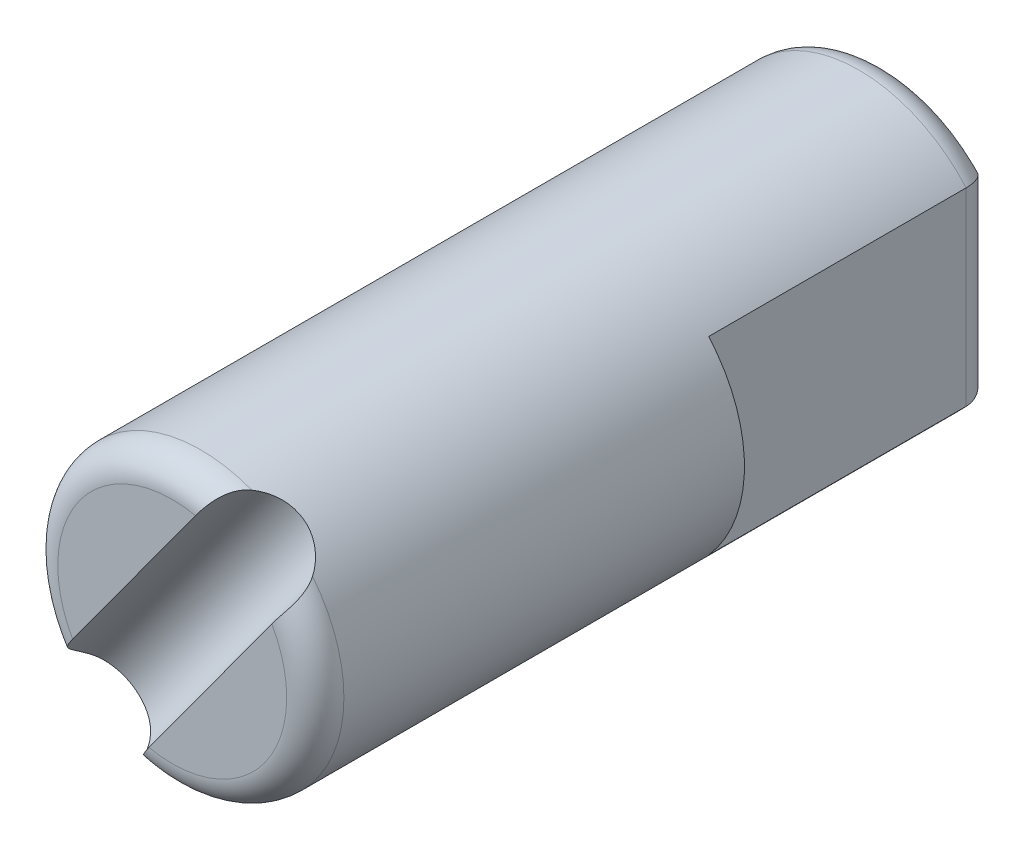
ISO-10303-21;
HEADER;
FILE_DESCRIPTION(('STEP AP214'),'2;1');
FILE_NAME('part.step','',(''),(''),'','','');
FILE_SCHEMA(('AUTOMOTIVE_DESIGN { 1 0 10303 214 1 1 1 1 }'));
ENDSEC;
DATA;
#1=APPLICATION_CONTEXT('core data for automotive mechanical design processes');
#2=APPLICATION_PROTOCOL_DEFINITION('international standard','automotive_design',2000,#1);
#3=PRODUCT_CONTEXT('',#1,'mechanical');
#4=PRODUCT('Part','Part','',(#3));
#5=PRODUCT_RELATED_PRODUCT_CATEGORY('part','',(#4));
#6=PRODUCT_DEFINITION_FORMATION('','',#4);
#7=PRODUCT_DEFINITION_CONTEXT('part definition',#1,'design');
#8=PRODUCT_DEFINITION('design','',#6,#7);
#9=PRODUCT_DEFINITION_SHAPE('','',#8);
#10=(LENGTH_UNIT() NAMED_UNIT(*) SI_UNIT(.MILLI.,.METRE.));
#11=(NAMED_UNIT(*) PLANE_ANGLE_UNIT() SI_UNIT($,.RADIAN.));
#12=(NAMED_UNIT(*) SI_UNIT($,.STERADIAN.) SOLID_ANGLE_UNIT());
#13=UNCERTAINTY_MEASURE_WITH_UNIT(LENGTH_MEASURE(1.E-05),#10,'distance_accuracy_value','');
#14=(GEOMETRIC_REPRESENTATION_CONTEXT(3) GLOBAL_UNCERTAINTY_ASSIGNED_CONTEXT((#13)) GLOBAL_UNIT_ASSIGNED_CONTEXT((#10,
#11,#12)) REPRESENTATION_CONTEXT('',''));
#15=CARTESIAN_POINT('',(0.,0.,0.));
#16=DIRECTION('',(0.,0.,1.));
#17=DIRECTION('',(1.,0.,0.));
#18=AXIS2_PLACEMENT_3D('',#15,#16,#17);
#19=CARTESIAN_POINT('',(0.,0.,50.));
#20=DIRECTION('',(0.,0.,1.));
#21=DIRECTION('',(1.,0.,0.));
#22=AXIS2_PLACEMENT_3D('',#19,#20,#21);
#23=PLANE('',#22);
#24=DIRECTION('',(0.589196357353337,0.807989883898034,0.));
#25=VECTOR('',#24,1.);
#26=CARTESIAN_POINT('',(8.90000447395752,6.60410325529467,50.));
#27=LINE('',#26,#25);
#28=CARTESIAN_POINT('',(-1.62749658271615,-7.83270418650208,50.));
#29=VERTEX_POINT('',#28);
#30=CARTESIAN_POINT('',(6.96022981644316,3.94400822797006,50.));
#31=VERTEX_POINT('',#30);
#32=EDGE_CURVE('E114',#29,#31,#27,.T.);
#33=ORIENTED_EDGE('',*,*,#32,.F.);
#34=CARTESIAN_POINT('',(0.,0.,50.));
#35=DIRECTION('',(0.,0.,1.));
#36=DIRECTION('',(1.,0.,0.));
#37=AXIS2_PLACEMENT_3D('',#34,#35,#36);
#38=CIRCLE('',#37,7.99999999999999);
#39=EDGE_CURVE('E125',#29,#31,#38,.T.);
#40=ORIENTED_EDGE('',*,*,#39,.T.);
#41=EDGE_LOOP('',(#33,#40));
#42=FACE_BOUND('',#41,.T.);
#43=ADVANCED_FACE('F32',(#42),#23,.T.);
#44=CARTESIAN_POINT('',(0.,0.,48.));
#45=DIRECTION('',(0.,0.,1.));
#46=DIRECTION('',(1.,0.,0.));
#47=AXIS2_PLACEMENT_3D('',#44,#45,#46);
#48=TOROIDAL_SURFACE('',#47,7.99999999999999,2.);
#49=CARTESIAN_POINT('',(3.56463353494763,9.34309304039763,47.9998));
#50=CARTESIAN_POINT('',(3.52757732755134,9.35724684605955,48.0500111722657));
#51=CARTESIAN_POINT('',(3.49079239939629,9.36899937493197,48.1011105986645));
#52=CARTESIAN_POINT('',(3.41774052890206,9.3874484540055,48.2045984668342));
#53=CARTESIAN_POINT('',(3.38147374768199,9.39414346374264,48.2569872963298));
#54=CARTESIAN_POINT('',(3.30947471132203,9.40221306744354,48.3625080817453));
#55=CARTESIAN_POINT('',(3.27374219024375,9.40359040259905,48.4156396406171));
#56=CARTESIAN_POINT('',(3.20277851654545,9.40089063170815,48.5220676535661));
#57=CARTESIAN_POINT('',(3.16754729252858,9.39681431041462,48.5753640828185));
#58=CARTESIAN_POINT('',(3.06232871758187,9.37622633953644,48.7349036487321));
#59=CARTESIAN_POINT('',(2.99294805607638,9.35134001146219,48.8405993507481));
#60=CARTESIAN_POINT('',(2.85535411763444,9.28000669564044,49.0450242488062));
#61=CARTESIAN_POINT('',(2.7871398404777,9.23357925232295,49.1437596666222));
#62=CARTESIAN_POINT('',(2.65301511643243,9.12338388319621,49.3264695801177));
#63=CARTESIAN_POINT('',(2.58710472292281,9.06025503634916,49.4108301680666));
#64=CARTESIAN_POINT('',(2.45420304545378,8.91913828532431,49.5650988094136));
#65=CARTESIAN_POINT('',(2.38721127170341,8.8411434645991,49.6350001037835));
#66=CARTESIAN_POINT('',(2.25048564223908,8.67300977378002,49.758379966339));
#67=CARTESIAN_POINT('',(2.18072777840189,8.58272936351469,49.8116388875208));
#68=CARTESIAN_POINT('',(2.03902033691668,8.39490313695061,49.898809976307));
#69=CARTESIAN_POINT('',(1.96707112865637,8.29735854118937,49.9327253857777));
#70=CARTESIAN_POINT('',(1.81976564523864,8.09643629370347,49.9811725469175));
#71=CARTESIAN_POINT('',(1.7443690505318,7.99297578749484,49.9952358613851));
#72=CARTESIAN_POINT('',(1.59311787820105,7.78555923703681,50.0027269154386));
#73=CARTESIAN_POINT('',(1.51726297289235,7.68160285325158,49.9961375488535));
#74=CARTESIAN_POINT('',(1.36373413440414,7.47070521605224,49.9621433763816));
#75=CARTESIAN_POINT('',(1.28614696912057,7.36385932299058,49.9337571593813));
#76=CARTESIAN_POINT('',(1.13638198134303,7.15424471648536,49.85551803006));
#77=CARTESIAN_POINT('',(1.06420166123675,7.0514741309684,49.8056751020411));
#78=CARTESIAN_POINT('',(0.947779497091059,6.87794084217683,49.7002384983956));
#79=CARTESIAN_POINT('',(0.901155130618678,6.80580805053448,49.6495162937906));
#80=CARTESIAN_POINT('',(0.816661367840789,6.66599274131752,49.536054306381));
#81=CARTESIAN_POINT('',(0.778775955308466,6.59830224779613,49.4733368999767));
#82=CARTESIAN_POINT('',(0.723244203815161,6.48447139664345,49.3523198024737));
#83=CARTESIAN_POINT('',(0.702929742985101,6.43702322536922,49.296489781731));
#84=CARTESIAN_POINT('',(0.671917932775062,6.34696648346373,49.1785834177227));
#85=CARTESIAN_POINT('',(0.661209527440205,6.30435239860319,49.1165143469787));
#86=CARTESIAN_POINT('',(0.651322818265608,6.22494593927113,48.9871582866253));
#87=CARTESIAN_POINT('',(0.65223321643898,6.18820052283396,48.9198350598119));
#88=CARTESIAN_POINT('',(0.666755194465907,6.1219340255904,48.783077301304));
#89=CARTESIAN_POINT('',(0.680360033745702,6.09240912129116,48.7136439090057));
#90=CARTESIAN_POINT('',(0.717415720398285,6.04333864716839,48.5829829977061));
#91=CARTESIAN_POINT('',(0.739655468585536,6.02306279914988,48.5216733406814));
#92=CARTESIAN_POINT('',(0.792385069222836,5.98750909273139,48.4010806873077));
#93=CARTESIAN_POINT('',(0.822892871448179,5.97224227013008,48.3418024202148));
#94=CARTESIAN_POINT('',(0.886018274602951,5.94755003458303,48.234112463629));
#95=CARTESIAN_POINT('',(0.917797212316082,5.93761462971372,48.1853130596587));
#96=CARTESIAN_POINT('',(0.985269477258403,5.92016508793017,48.0905135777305));
#97=CARTESIAN_POINT('',(1.02093609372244,5.91263567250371,48.0444974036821));
#98=CARTESIAN_POINT('',(1.05822097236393,5.90594348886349,47.9998));
#99=B_SPLINE_CURVE_WITH_KNOTS('',3,(#49,#50,#51,#52,#53,#54,#55,#56,#57,#58,#59,#60,#61,#62,#63,
#64,#65,#66,#67,#68,#69,#70,#71,#72,#73,#74,#75,#76,#77,#78,#79,#80,#81,#82,#83,#84,#85,#86,#87,
#88,#89,#90,#91,#92,#93,#94,#95,#96,#97,#98),.UNSPECIFIED.,.F.,.F.,(4,2,2,2,2,2,2,2,2,2,2,2,2,2,
2,2,2,2,2,2,2,2,2,2,4),(0.,0.19192973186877,0.383917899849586,0.575807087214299,
0.76766866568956,1.15209635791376,1.53617593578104,1.90727493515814,2.27854701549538,
2.65453025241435,3.03045045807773,3.41510065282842,3.80006952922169,4.20346831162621,
4.60667958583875,4.90496817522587,5.20270565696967,5.42995121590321,5.65693489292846,
5.8856524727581,6.11424867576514,6.31835257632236,6.52290318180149,6.69988226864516,
6.87571407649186),.UNSPECIFIED.);
#100=CARTESIAN_POINT('',(3.56448597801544,9.34314934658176,48.));
#101=VERTEX_POINT('',#100);
#102=CARTESIAN_POINT('',(1.62749658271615,7.83270418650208,50.));
#103=VERTEX_POINT('',#102);
#104=EDGE_CURVE('E12',#101,#103,#99,.T.);
#105=ORIENTED_EDGE('',*,*,#104,.F.);
#106=CARTESIAN_POINT('',(0.,0.,48.));
#107=DIRECTION('',(0.,0.,1.));
#108=DIRECTION('',(1.,0.,0.));
#109=AXIS2_PLACEMENT_3D('',#106,#107,#108);
#110=CIRCLE('',#109,9.99999999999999);
#111=CARTESIAN_POINT('',(-7.80624048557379,-6.25000875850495,48.));
#112=VERTEX_POINT('',#111);
#113=EDGE_CURVE('E246',#112,#101,#110,.F.);
#114=ORIENTED_EDGE('',*,*,#113,.F.);
#115=CARTESIAN_POINT('',(-5.2997292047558,-2.81298248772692,47.9998));
#116=CARTESIAN_POINT('',(-5.32494747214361,-2.76554222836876,48.0631389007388));
#117=CARTESIAN_POINT('',(-5.35080144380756,-2.72162487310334,48.129345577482));
#118=CARTESIAN_POINT('',(-5.40513800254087,-2.64341208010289,48.267434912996));
#119=CARTESIAN_POINT('',(-5.43365062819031,-2.60925044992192,48.3393806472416));
#120=CARTESIAN_POINT('',(-5.49434556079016,-2.55427085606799,48.4878910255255));
#121=CARTESIAN_POINT('',(-5.52656068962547,-2.53358513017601,48.5644936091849));
#122=CARTESIAN_POINT('',(-5.59477755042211,-2.50928679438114,48.7182392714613));
#123=CARTESIAN_POINT('',(-5.63075269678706,-2.5055616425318,48.7953753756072));
#124=CARTESIAN_POINT('',(-5.70076219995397,-2.51492526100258,48.9355540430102));
#125=CARTESIAN_POINT('',(-5.73431157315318,-2.52563586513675,48.9990085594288));
#126=CARTESIAN_POINT('',(-5.80355275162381,-2.55872756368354,49.1216995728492));
#127=CARTESIAN_POINT('',(-5.83924958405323,-2.58113706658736,49.1809254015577));
#128=CARTESIAN_POINT('',(-5.92033409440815,-2.64177635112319,49.3062940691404));
#129=CARTESIAN_POINT('',(-5.96609959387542,-2.68242710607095,49.3710089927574));
#130=CARTESIAN_POINT('',(-6.05919009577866,-2.77444874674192,49.4909377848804));
#131=CARTESIAN_POINT('',(-6.10651733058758,-2.82583559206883,49.5461372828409));
#132=CARTESIAN_POINT('',(-6.21971119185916,-2.95616550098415,49.6651760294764));
#133=CARTESIAN_POINT('',(-6.2861038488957,-3.03836021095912,49.7249426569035));
#134=CARTESIAN_POINT('',(-6.42087064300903,-3.21138198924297,49.827114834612));
#135=CARTESIAN_POINT('',(-6.48924684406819,-3.30221829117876,49.8695015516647));
#136=CARTESIAN_POINT('',(-6.6292459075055,-3.49081018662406,49.9376438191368));
#137=CARTESIAN_POINT('',(-6.70090687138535,-3.58867167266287,49.9630275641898));
#138=CARTESIAN_POINT('',(-6.84540674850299,-3.78648621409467,49.9952633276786));
#139=CARTESIAN_POINT('',(-6.91824523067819,-3.88643850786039,50.0021219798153));
#140=CARTESIAN_POINT('',(-7.07182059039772,-4.09703142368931,49.996446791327));
#141=CARTESIAN_POINT('',(-7.15254231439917,-4.20763467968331,49.9816900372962));
#142=CARTESIAN_POINT('',(-7.31053585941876,-4.42553916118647,49.9283055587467));
#143=CARTESIAN_POINT('',(-7.38780765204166,-4.53284035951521,49.8896776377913));
#144=CARTESIAN_POINT('',(-7.531254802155,-4.73767343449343,49.7915653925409));
#145=CARTESIAN_POINT('',(-7.59775976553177,-4.83542632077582,49.7330244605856));
#146=CARTESIAN_POINT('',(-7.71880025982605,-5.02498466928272,49.5970045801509));
#147=CARTESIAN_POINT('',(-7.77333828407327,-5.11679136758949,49.5195295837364));
#148=CARTESIAN_POINT('',(-7.86434244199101,-5.29104779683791,49.3520853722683));
#149=CARTESIAN_POINT('',(-7.90137147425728,-5.37371197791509,49.2626448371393));
#150=CARTESIAN_POINT('',(-7.95676390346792,-5.53332686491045,49.0734858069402));
#151=CARTESIAN_POINT('',(-7.97513161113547,-5.61027888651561,48.9737696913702));
#152=CARTESIAN_POINT('',(-7.99096976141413,-5.75729152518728,48.7709470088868));
#153=CARTESIAN_POINT('',(-7.9888581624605,-5.82746057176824,48.6679508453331));
#154=CARTESIAN_POINT('',(-7.96421921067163,-5.96308753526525,48.461330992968));
#155=CARTESIAN_POINT('',(-7.94170233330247,-6.02854785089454,48.3577076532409));
#156=CARTESIAN_POINT('',(-7.89571880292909,-6.1190073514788,48.2123854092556));
#157=CARTESIAN_POINT('',(-7.88014466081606,-6.14575581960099,48.1691316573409));
#158=CARTESIAN_POINT('',(-7.84562975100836,-6.19848367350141,48.0836587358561));
#159=CARTESIAN_POINT('',(-7.82669675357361,-6.22446467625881,48.0414374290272));
#160=CARTESIAN_POINT('',(-7.80614176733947,-6.2501320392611,47.9997999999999));
#161=B_SPLINE_CURVE_WITH_KNOTS('',3,(#115,#116,#117,#118,#119,#120,#121,#122,#123,#124,#125,
#126,#127,#128,#129,#130,#131,#132,#133,#134,#135,#136,#137,#138,#139,#140,#141,#142,#143,#144,
#145,#146,#147,#148,#149,#150,#151,#152,#153,#154,#155,#156,#157,#158,#159,#160),.UNSPECIFIED.,
.F.,.F.,(4,2,2,2,2,2,2,2,2,2,2,2,2,2,2,2,2,2,2,2,2,2,4),(0.,0.249615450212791,0.502506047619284,
0.757842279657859,1.01148173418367,1.22804565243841,1.44513791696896,1.71092088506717,
1.97710179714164,2.33935625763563,2.70200223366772,3.0723397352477,3.44254460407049,
3.85359154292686,4.2646418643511,4.65844028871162,5.0521565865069,5.43217032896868,
5.81209626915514,6.18428495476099,6.55628267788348,6.71574746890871,6.87484805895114),.UNSPECIFIED.);
#162=CARTESIAN_POINT('',(-6.96022981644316,-3.94400822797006,50.));
#163=VERTEX_POINT('',#162);
#164=EDGE_CURVE('E120',#163,#112,#161,.T.);
#165=ORIENTED_EDGE('',*,*,#164,.F.);
#166=EDGE_CURVE('E121',#103,#163,#38,.T.);
#167=ORIENTED_EDGE('',*,*,#166,.F.);
#168=EDGE_LOOP('',(#105,#114,#165,#167));
#169=FACE_BOUND('',#168,.T.);
#170=ADVANCED_FACE('F205',(#169),#48,.T.);
#171=CARTESIAN_POINT('',(0.,0.,50.));
#172=DIRECTION('',(0.,0.,-1.));
#173=DIRECTION('',(-1.,0.,0.));
#174=AXIS2_PLACEMENT_3D('',#171,#172,#173);
#175=CYLINDRICAL_SURFACE('',#174,9.99999999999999);
#176=ORIENTED_EDGE('',*,*,#113,.T.);
#177=CARTESIAN_POINT('',(3.56448597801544,9.34314934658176,48.));
#178=CARTESIAN_POINT('',(3.61917920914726,9.32228215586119,47.9258715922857));
#179=CARTESIAN_POINT('',(3.67653799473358,9.29984980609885,47.8542105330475));
#180=CARTESIAN_POINT('',(3.796067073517,9.25170467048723,47.7161957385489));
#181=CARTESIAN_POINT('',(3.85823751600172,9.22599178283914,47.64984216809));
#182=CARTESIAN_POINT('',(4.05122312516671,9.14369145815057,47.4592672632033));
#183=CARTESIAN_POINT('',(4.18847651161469,9.08195566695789,47.3435801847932));
#184=CARTESIAN_POINT('',(4.47504764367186,8.94422943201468,47.1383659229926));
#185=CARTESIAN_POINT('',(4.6243776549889,8.86822438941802,47.048865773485));
#186=CARTESIAN_POINT('',(4.92963860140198,8.7022273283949,46.8990395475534));
#187=CARTESIAN_POINT('',(5.08556333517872,8.61224824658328,46.8386866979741));
#188=CARTESIAN_POINT('',(5.39420144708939,8.42226250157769,46.7505516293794));
#189=CARTESIAN_POINT('',(5.54688361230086,8.32260409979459,46.7219106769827));
#190=CARTESIAN_POINT('',(5.84829578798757,8.11363289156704,46.695347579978));
#191=CARTESIAN_POINT('',(5.99702580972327,8.00432011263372,46.6974253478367));
#192=CARTESIAN_POINT('',(6.28043854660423,7.78377394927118,46.7315476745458));
#193=CARTESIAN_POINT('',(6.41544015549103,7.67277088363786,46.7624520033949));
#194=CARTESIAN_POINT('',(6.67428795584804,7.44870450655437,46.8514997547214));
#195=CARTESIAN_POINT('',(6.79813262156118,7.33564091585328,46.909646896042));
#196=CARTESIAN_POINT('',(7.03394400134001,7.10990035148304,47.052288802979));
#197=CARTESIAN_POINT('',(7.14571868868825,6.99725129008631,47.13714339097));
#198=CARTESIAN_POINT('',(7.35381419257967,6.778217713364,47.3304921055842));
#199=CARTESIAN_POINT('',(7.45014219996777,6.6718302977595,47.4389751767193));
#200=CARTESIAN_POINT('',(7.58827822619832,6.51335964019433,47.6252464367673));
#201=CARTESIAN_POINT('',(7.63564320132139,6.45769575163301,47.6960085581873));
#202=CARTESIAN_POINT('',(7.72496769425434,6.35056849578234,47.8435743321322));
#203=CARTESIAN_POINT('',(7.76693783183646,6.29909695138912,47.9203656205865));
#204=CARTESIAN_POINT('',(7.80624048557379,6.25000875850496,48.));
#205=B_SPLINE_CURVE_WITH_KNOTS('',3,(#177,#178,#179,#180,#181,#182,#183,#184,#185,#186,#187,
#188,#189,#190,#191,#192,#193,#194,#195,#196,#197,#198,#199,#200,#201,#202,#203,#204),
.UNSPECIFIED.,.F.,.F.,(4,2,2,2,2,2,2,2,2,2,2,2,2,4),(0.,0.283190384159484,0.566389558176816,
1.1329711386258,1.70013557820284,2.26677805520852,2.81766955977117,3.36855949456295,
3.89854319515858,4.42859926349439,4.96612657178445,5.50340291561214,5.80822925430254,
6.11244603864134),.UNSPECIFIED.);
#206=CARTESIAN_POINT('',(7.80624048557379,6.25000875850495,48.));
#207=VERTEX_POINT('',#206);
#208=EDGE_CURVE('E126',#101,#207,#205,.T.);
#209=ORIENTED_EDGE('',*,*,#208,.T.);
#210=CARTESIAN_POINT('',(-3.56448597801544,-9.34314934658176,48.));
#211=VERTEX_POINT('',#210);
#212=EDGE_CURVE('E245',#207,#211,#110,.F.);
#213=ORIENTED_EDGE('',*,*,#212,.T.);
#214=CARTESIAN_POINT('',(-3.56448597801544,-9.34314934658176,48.));
#215=CARTESIAN_POINT('',(-3.61917920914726,-9.32228215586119,47.9258715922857));
#216=CARTESIAN_POINT('',(-3.67653799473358,-9.29984980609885,47.8542105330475));
#217=CARTESIAN_POINT('',(-3.796067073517,-9.25170467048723,47.7161957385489));
#218=CARTESIAN_POINT('',(-3.85823751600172,-9.22599178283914,47.64984216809));
#219=CARTESIAN_POINT('',(-4.05122312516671,-9.14369145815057,47.4592672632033));
#220=CARTESIAN_POINT('',(-4.18847651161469,-9.08195566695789,47.3435801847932));
#221=CARTESIAN_POINT('',(-4.47504764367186,-8.94422943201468,47.1383659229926));
#222=CARTESIAN_POINT('',(-4.6243776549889,-8.86822438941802,47.048865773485));
#223=CARTESIAN_POINT('',(-4.92963860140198,-8.7022273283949,46.8990395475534));
#224=CARTESIAN_POINT('',(-5.08556333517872,-8.61224824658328,46.8386866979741));
#225=CARTESIAN_POINT('',(-5.39420144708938,-8.42226250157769,46.7505516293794));
#226=CARTESIAN_POINT('',(-5.54688361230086,-8.32260409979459,46.7219106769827));
#227=CARTESIAN_POINT('',(-5.84829578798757,-8.11363289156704,46.695347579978));
#228=CARTESIAN_POINT('',(-5.99702580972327,-8.00432011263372,46.6974253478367));
#229=CARTESIAN_POINT('',(-6.28043854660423,-7.78377394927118,46.7315476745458));
#230=CARTESIAN_POINT('',(-6.41544015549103,-7.67277088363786,46.7624520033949));
#231=CARTESIAN_POINT('',(-6.67428795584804,-7.44870450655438,46.8514997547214));
#232=CARTESIAN_POINT('',(-6.79813262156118,-7.33564091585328,46.909646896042));
#233=CARTESIAN_POINT('',(-7.03394400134,-7.10990035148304,47.052288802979));
#234=CARTESIAN_POINT('',(-7.14571868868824,-6.99725129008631,47.13714339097));
#235=CARTESIAN_POINT('',(-7.35381419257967,-6.77821771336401,47.3304921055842));
#236=CARTESIAN_POINT('',(-7.45014219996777,-6.6718302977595,47.4389751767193));
#237=CARTESIAN_POINT('',(-7.58827822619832,-6.51335964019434,47.6252464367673));
#238=CARTESIAN_POINT('',(-7.63564320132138,-6.45769575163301,47.6960085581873));
#239=CARTESIAN_POINT('',(-7.72496769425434,-6.35056849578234,47.8435743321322));
#240=CARTESIAN_POINT('',(-7.76693783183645,-6.29909695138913,47.9203656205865));
#241=CARTESIAN_POINT('',(-7.80624048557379,-6.25000875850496,48.));
#242=B_SPLINE_CURVE_WITH_KNOTS('',3,(#214,#215,#216,#217,#218,#219,#220,#221,#222,#223,#224,
#225,#226,#227,#228,#229,#230,#231,#232,#233,#234,#235,#236,#237,#238,#239,#240,#241),
.UNSPECIFIED.,.F.,.F.,(4,2,2,2,2,2,2,2,2,2,2,2,2,4),(0.,0.283190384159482,0.566389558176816,
1.1329711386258,1.70013557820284,2.26677805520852,2.81766955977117,3.36855949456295,
3.89854319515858,4.42859926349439,4.96612657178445,5.50340291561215,5.80822925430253,
6.11244603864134),.UNSPECIFIED.);
#243=EDGE_CURVE('E52',#211,#112,#242,.T.);
#244=ORIENTED_EDGE('',*,*,#243,.T.);
#245=EDGE_LOOP('',(#176,#209,#213,#244));
#246=FACE_BOUND('',#245,.T.);
#247=DIRECTION('',(0.,0.,-1.));
#248=VECTOR('',#247,1.);
#249=CARTESIAN_POINT('',(-7.5,-6.61437827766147,50.));
#250=LINE('',#249,#248);
#251=CARTESIAN_POINT('',(-7.5,-6.61437827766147,2.));
#252=VERTEX_POINT('',#251);
#253=CARTESIAN_POINT('',(-7.5,-6.61437827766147,20.));
#254=VERTEX_POINT('',#253);
#255=EDGE_CURVE('E220',#252,#254,#250,.F.);
#256=ORIENTED_EDGE('',*,*,#255,.F.);
#257=CARTESIAN_POINT('',(0.,0.,2.));
#258=DIRECTION('',(0.,0.,1.));
#259=DIRECTION('',(1.,0.,0.));
#260=AXIS2_PLACEMENT_3D('',#257,#258,#259);
#261=CIRCLE('',#260,9.99999999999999);
#262=CARTESIAN_POINT('',(7.5,-6.61437827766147,2.));
#263=VERTEX_POINT('',#262);
#264=EDGE_CURVE('E128',#252,#263,#261,.T.);
#265=ORIENTED_EDGE('',*,*,#264,.T.);
#266=DIRECTION('',(0.,0.,-1.));
#267=VECTOR('',#266,1.);
#268=CARTESIAN_POINT('',(7.5,-6.61437827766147,50.));
#269=LINE('',#268,#267);
#270=CARTESIAN_POINT('',(7.5,-6.61437827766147,20.));
#271=VERTEX_POINT('',#270);
#272=EDGE_CURVE('E226',#271,#263,#269,.T.);
#273=ORIENTED_EDGE('',*,*,#272,.F.);
#274=CARTESIAN_POINT('',(0.,0.,20.));
#275=DIRECTION('',(0.,0.,-1.));
#276=DIRECTION('',(-1.,0.,0.));
#277=AXIS2_PLACEMENT_3D('',#274,#275,#276);
#278=CIRCLE('',#277,9.99999999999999);
#279=CARTESIAN_POINT('',(7.5,6.61437827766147,20.));
#280=VERTEX_POINT('',#279);
#281=EDGE_CURVE('E231',#280,#271,#278,.T.);
#282=ORIENTED_EDGE('',*,*,#281,.F.);
#283=DIRECTION('',(0.,0.,-1.));
#284=VECTOR('',#283,1.);
#285=CARTESIAN_POINT('',(7.5,6.61437827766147,50.));
#286=LINE('',#285,#284);
#287=CARTESIAN_POINT('',(7.5,6.61437827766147,2.));
#288=VERTEX_POINT('',#287);
#289=EDGE_CURVE('E224',#288,#280,#286,.F.);
#290=ORIENTED_EDGE('',*,*,#289,.F.);
#291=CARTESIAN_POINT('',(0.,0.,2.));
#292=DIRECTION('',(0.,0.,1.));
#293=DIRECTION('',(1.,0.,0.));
#294=AXIS2_PLACEMENT_3D('',#291,#292,#293);
#295=CIRCLE('',#294,9.99999999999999);
#296=CARTESIAN_POINT('',(-7.5,6.61437827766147,2.));
#297=VERTEX_POINT('',#296);
#298=EDGE_CURVE('E131',#288,#297,#295,.T.);
#299=ORIENTED_EDGE('',*,*,#298,.T.);
#300=DIRECTION('',(0.,0.,-1.));
#301=VECTOR('',#300,1.);
#302=CARTESIAN_POINT('',(-7.5,6.61437827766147,50.));
#303=LINE('',#302,#301);
#304=CARTESIAN_POINT('',(-7.5,6.61437827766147,20.));
#305=VERTEX_POINT('',#304);
#306=EDGE_CURVE('E222',#305,#297,#303,.T.);
#307=ORIENTED_EDGE('',*,*,#306,.F.);
#308=EDGE_CURVE('E229',#254,#305,#278,.T.);
#309=ORIENTED_EDGE('',*,*,#308,.F.);
#310=EDGE_LOOP('',(#256,#265,#273,#282,#290,#299,#307,#309));
#311=FACE_BOUND('',#310,.T.);
#312=ADVANCED_FACE('F200',(#246,#311),#175,.T.);
#313=CARTESIAN_POINT('',(0.,0.,0.));
#314=DIRECTION('',(0.,0.,1.));
#315=DIRECTION('',(1.,0.,0.));
#316=AXIS2_PLACEMENT_3D('',#313,#314,#315);
#317=PLANE('',#316);
#318=DIRECTION('',(0.,1.,0.));
#319=VECTOR('',#318,1.);
#320=CARTESIAN_POINT('',(5.5,-6.61437827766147,0.));
#321=LINE('',#320,#319);
#322=CARTESIAN_POINT('',(5.5,5.80947501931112,0.));
#323=VERTEX_POINT('',#322);
#324=CARTESIAN_POINT('',(5.5,-5.80947501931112,0.));
#325=VERTEX_POINT('',#324);
#326=EDGE_CURVE('E239',#323,#325,#321,.F.);
#327=ORIENTED_EDGE('',*,*,#326,.T.);
#328=CARTESIAN_POINT('',(0.,0.,0.));
#329=DIRECTION('',(0.,0.,1.));
#330=DIRECTION('',(1.,0.,0.));
#331=AXIS2_PLACEMENT_3D('',#328,#329,#330);
#332=CIRCLE('',#331,7.99999999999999);
#333=CARTESIAN_POINT('',(-5.5,-5.80947501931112,0.));
#334=VERTEX_POINT('',#333);
#335=EDGE_CURVE('E242',#325,#334,#332,.F.);
#336=ORIENTED_EDGE('',*,*,#335,.T.);
#337=DIRECTION('',(0.,-1.,0.));
#338=VECTOR('',#337,1.);
#339=CARTESIAN_POINT('',(-5.5,6.61437827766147,0.));
#340=LINE('',#339,#338);
#341=CARTESIAN_POINT('',(-5.5,5.80947501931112,0.));
#342=VERTEX_POINT('',#341);
#343=EDGE_CURVE('E237',#334,#342,#340,.F.);
#344=ORIENTED_EDGE('',*,*,#343,.T.);
#345=CARTESIAN_POINT('',(0.,0.,0.));
#346=DIRECTION('',(0.,0.,1.));
#347=DIRECTION('',(1.,0.,0.));
#348=AXIS2_PLACEMENT_3D('',#345,#346,#347);
#349=CIRCLE('',#348,7.99999999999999);
#350=EDGE_CURVE('E235',#342,#323,#349,.F.);
#351=ORIENTED_EDGE('',*,*,#350,.T.);
#352=EDGE_LOOP('',(#327,#336,#344,#351));
#353=FACE_BOUND('',#352,.T.);
#354=ADVANCED_FACE('F204',(#353),#317,.F.);
#355=DIRECTION('',(0.589196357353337,0.807989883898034,0.));
#356=VECTOR('',#355,1.);
#357=CARTESIAN_POINT('',(3.56727124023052,10.4927992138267,50.));
#358=LINE('',#357,#356);
#359=EDGE_CURVE('E143',#103,#163,#358,.F.);
#360=ORIENTED_EDGE('',*,*,#359,.F.);
#361=ORIENTED_EDGE('',*,*,#166,.T.);
#362=EDGE_LOOP('',(#360,#361));
#363=FACE_BOUND('',#362,.T.);
#364=ADVANCED_FACE('F259',(#363),#23,.T.);
#365=CARTESIAN_POINT('',(-7.5,10.,20.));
#366=DIRECTION('',(-1.,0.,0.));
#367=DIRECTION('',(0.,-1.,0.));
#368=AXIS2_PLACEMENT_3D('',#365,#366,#367);
#369=PLANE('',#368);
#370=ORIENTED_EDGE('',*,*,#306,.T.);
#371=DIRECTION('',(0.,-1.,0.));
#372=VECTOR('',#371,1.);
#373=CARTESIAN_POINT('',(-7.5,-6.61437827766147,2.));
#374=LINE('',#373,#372);
#375=EDGE_CURVE('E60',#297,#252,#374,.T.);
#376=ORIENTED_EDGE('',*,*,#375,.T.);
#377=ORIENTED_EDGE('',*,*,#255,.T.);
#378=DIRECTION('',(0.,1.,0.));
#379=VECTOR('',#378,1.);
#380=CARTESIAN_POINT('',(-7.5,10.,20.));
#381=LINE('',#380,#379);
#382=EDGE_CURVE('E217',#254,#305,#381,.T.);
#383=ORIENTED_EDGE('',*,*,#382,.T.);
#384=EDGE_LOOP('',(#370,#376,#377,#383));
#385=FACE_BOUND('',#384,.T.);
#386=ADVANCED_FACE('F185',(#385),#369,.T.);
#387=CARTESIAN_POINT('',(0.,-0.549549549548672,20.));
#388=DIRECTION('',(0.,0.,-1.));
#389=DIRECTION('',(-1.,0.,0.));
#390=AXIS2_PLACEMENT_3D('',#387,#388,#389);
#391=PLANE('',#390);
#392=ORIENTED_EDGE('',*,*,#308,.T.);
#393=ORIENTED_EDGE('',*,*,#382,.F.);
#394=EDGE_LOOP('',(#392,#393));
#395=FACE_BOUND('',#394,.T.);
#396=ADVANCED_FACE('F265',(#395),#391,.T.);
#397=ORIENTED_EDGE('',*,*,#281,.T.);
#398=DIRECTION('',(0.,-1.,0.));
#399=VECTOR('',#398,1.);
#400=CARTESIAN_POINT('',(7.5,10.,20.));
#401=LINE('',#400,#399);
#402=EDGE_CURVE('E170',#280,#271,#401,.T.);
#403=ORIENTED_EDGE('',*,*,#402,.F.);
#404=EDGE_LOOP('',(#397,#403));
#405=FACE_BOUND('',#404,.T.);
#406=ADVANCED_FACE('F328',(#405),#391,.T.);
#407=CARTESIAN_POINT('',(7.5,10.,20.));
#408=DIRECTION('',(1.,0.,0.));
#409=DIRECTION('',(0.,1.,0.));
#410=AXIS2_PLACEMENT_3D('',#407,#408,#409);
#411=PLANE('',#410);
#412=ORIENTED_EDGE('',*,*,#272,.T.);
#413=DIRECTION('',(0.,1.,0.));
#414=VECTOR('',#413,1.);
#415=CARTESIAN_POINT('',(7.5,6.61437827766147,2.));
#416=LINE('',#415,#414);
#417=EDGE_CURVE('E232',#263,#288,#416,.T.);
#418=ORIENTED_EDGE('',*,*,#417,.T.);
#419=ORIENTED_EDGE('',*,*,#289,.T.);
#420=ORIENTED_EDGE('',*,*,#402,.T.);
#421=EDGE_LOOP('',(#412,#418,#419,#420));
#422=FACE_BOUND('',#421,.T.);
#423=ADVANCED_FACE('F320',(#422),#411,.T.);
#424=CARTESIAN_POINT('',(-5.5,10.,2.));
#425=DIRECTION('',(0.,1.,0.));
#426=DIRECTION('',(-1.,0.,0.));
#427=AXIS2_PLACEMENT_3D('',#424,#425,#426);
#428=CYLINDRICAL_SURFACE('',#427,2.);
#429=CARTESIAN_POINT('',(-7.5,6.61437827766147,2.));
#430=CARTESIAN_POINT('',(-7.50000711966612,6.61438034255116,1.94645100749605));
#431=CARTESIAN_POINT('',(-7.4978495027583,6.61356544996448,1.89290557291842));
#432=CARTESIAN_POINT('',(-7.48925941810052,6.61031783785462,1.78621679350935));
#433=CARTESIAN_POINT('',(-7.4828276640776,6.60788538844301,1.7330733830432));
#434=CARTESIAN_POINT('',(-7.46576384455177,6.60142629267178,1.62768870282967));
#435=CARTESIAN_POINT('',(-7.45514162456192,6.59740338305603,1.57544561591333));
#436=CARTESIAN_POINT('',(-7.42981255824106,6.58779823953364,1.4721201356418));
#437=CARTESIAN_POINT('',(-7.41510566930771,6.58221598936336,1.42103775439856));
#438=CARTESIAN_POINT('',(-7.36505287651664,6.56318732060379,1.27007767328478));
#439=CARTESIAN_POINT('',(-7.32375732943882,6.54745239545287,1.17238033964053));
#440=CARTESIAN_POINT('',(-7.22686594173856,6.51035112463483,0.985589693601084));
#441=CARTESIAN_POINT('',(-7.17126658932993,6.48898339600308,0.896498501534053));
#442=CARTESIAN_POINT('',(-7.04610762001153,6.44058513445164,0.726842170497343));
#443=CARTESIAN_POINT('',(-6.97623477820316,6.41342681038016,0.646544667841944));
#444=CARTESIAN_POINT('',(-6.82571065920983,6.35448039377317,0.498792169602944));
#445=CARTESIAN_POINT('',(-6.74505621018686,6.32269093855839,0.431340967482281));
#446=CARTESIAN_POINT('',(-6.57013938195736,6.25315734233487,0.306771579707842));
#447=CARTESIAN_POINT('',(-6.47534679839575,6.21516812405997,0.250535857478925));
#448=CARTESIAN_POINT('',(-6.27902821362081,6.13569217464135,0.154722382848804));
#449=CARTESIAN_POINT('',(-6.1774999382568,6.09420426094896,0.115150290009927));
#450=CARTESIAN_POINT('',(-5.98184782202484,6.01337597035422,0.0565274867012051));
#451=CARTESIAN_POINT('',(-5.88813729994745,5.97430104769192,0.035698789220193));
#452=CARTESIAN_POINT('',(-5.69941508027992,5.89479848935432,0.00768873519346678));
#453=CARTESIAN_POINT('',(-5.60440630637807,5.85437366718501,0.000480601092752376));
#454=CARTESIAN_POINT('',(-5.50642749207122,5.81224048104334,7.72806790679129E-06));
#455=CARTESIAN_POINT('',(-5.50321358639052,5.81085793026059,-1.83872279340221E-08));
#456=CARTESIAN_POINT('',(-5.5,5.80947501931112,0.));
#457=B_SPLINE_CURVE_WITH_KNOTS('',3,(#429,#430,#431,#432,#433,#434,#435,#436,#437,#438,#439,
#440,#441,#442,#443,#444,#445,#446,#447,#448,#449,#450,#451,#452,#453,#454,#455,#456),
.UNSPECIFIED.,.F.,.F.,(4,2,2,2,2,2,2,2,2,2,2,2,2,4),(0.,0.160591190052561,0.321155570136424,
0.481344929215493,0.641535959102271,0.961597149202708,1.28173699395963,1.60985079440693,
1.93806133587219,2.28631328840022,2.6346834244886,2.94474884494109,3.25420405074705,
3.2647000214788),.UNSPECIFIED.);
#458=EDGE_CURVE('E171',#342,#297,#457,.F.);
#459=ORIENTED_EDGE('',*,*,#458,.F.);
#460=ORIENTED_EDGE('',*,*,#343,.F.);
#461=CARTESIAN_POINT('',(-7.5,-6.61437827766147,2.));
#462=CARTESIAN_POINT('',(-7.50000711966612,-6.61438034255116,1.94645100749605));
#463=CARTESIAN_POINT('',(-7.4978495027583,-6.61356544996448,1.89290557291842));
#464=CARTESIAN_POINT('',(-7.48925941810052,-6.61031783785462,1.78621679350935));
#465=CARTESIAN_POINT('',(-7.4828276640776,-6.607885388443,1.7330733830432));
#466=CARTESIAN_POINT('',(-7.46576384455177,-6.60142629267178,1.62768870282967));
#467=CARTESIAN_POINT('',(-7.45514162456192,-6.59740338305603,1.57544561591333));
#468=CARTESIAN_POINT('',(-7.42981255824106,-6.58779823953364,1.4721201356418));
#469=CARTESIAN_POINT('',(-7.41510566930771,-6.58221598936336,1.42103775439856));
#470=CARTESIAN_POINT('',(-7.36505287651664,-6.56318732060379,1.27007767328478));
#471=CARTESIAN_POINT('',(-7.32375732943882,-6.54745239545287,1.17238033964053));
#472=CARTESIAN_POINT('',(-7.22686594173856,-6.51035112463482,0.985589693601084));
#473=CARTESIAN_POINT('',(-7.17126658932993,-6.48898339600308,0.896498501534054));
#474=CARTESIAN_POINT('',(-7.04610762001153,-6.44058513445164,0.726842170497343));
#475=CARTESIAN_POINT('',(-6.97623477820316,-6.41342681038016,0.646544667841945));
#476=CARTESIAN_POINT('',(-6.82571065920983,-6.35448039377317,0.498792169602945));
#477=CARTESIAN_POINT('',(-6.74505621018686,-6.32269093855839,0.431340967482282));
#478=CARTESIAN_POINT('',(-6.57013938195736,-6.25315734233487,0.306771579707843));
#479=CARTESIAN_POINT('',(-6.47534679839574,-6.21516812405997,0.250535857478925));
#480=CARTESIAN_POINT('',(-6.27902821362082,-6.13569217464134,0.154722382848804));
#481=CARTESIAN_POINT('',(-6.17749993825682,-6.09420426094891,0.115150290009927));
#482=CARTESIAN_POINT('',(-5.98184782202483,-6.01337597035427,0.0565274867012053));
#483=CARTESIAN_POINT('',(-5.88813729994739,-5.97430104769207,0.0356987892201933));
#484=CARTESIAN_POINT('',(-5.69941508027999,-5.89479848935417,0.00768873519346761));
#485=CARTESIAN_POINT('',(-5.60440630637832,-5.85437366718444,0.000480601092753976));
#486=CARTESIAN_POINT('',(-5.50642749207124,-5.8122404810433,7.72806790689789E-06));
#487=CARTESIAN_POINT('',(-5.50321358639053,-5.81085793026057,-1.83872278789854E-08));
#488=CARTESIAN_POINT('',(-5.5,-5.80947501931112,0.));
#489=B_SPLINE_CURVE_WITH_KNOTS('',3,(#461,#462,#463,#464,#465,#466,#467,#468,#469,#470,#471,
#472,#473,#474,#475,#476,#477,#478,#479,#480,#481,#482,#483,#484,#485,#486,#487,#488),
.UNSPECIFIED.,.F.,.F.,(4,2,2,2,2,2,2,2,2,2,2,2,2,4),(0.,0.160591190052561,0.321155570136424,
0.481344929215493,0.64153595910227,0.961597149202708,1.28173699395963,1.60985079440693,
1.93806133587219,2.28631328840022,2.63468342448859,2.94474884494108,3.25420405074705,
3.2647000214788),.UNSPECIFIED.);
#490=EDGE_CURVE('E165',#252,#334,#489,.T.);
#491=ORIENTED_EDGE('',*,*,#490,.F.);
#492=ORIENTED_EDGE('',*,*,#375,.F.);
#493=EDGE_LOOP('',(#459,#460,#491,#492));
#494=FACE_BOUND('',#493,.T.);
#495=ADVANCED_FACE('F160',(#494),#428,.T.);
#496=CARTESIAN_POINT('',(0.,0.,2.));
#497=DIRECTION('',(0.,0.,1.));
#498=DIRECTION('',(1.,0.,0.));
#499=AXIS2_PLACEMENT_3D('',#496,#497,#498);
#500=TOROIDAL_SURFACE('',#499,7.99999999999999,2.);
#501=ORIENTED_EDGE('',*,*,#490,.T.);
#502=ORIENTED_EDGE('',*,*,#335,.F.);
#503=CARTESIAN_POINT('',(7.5,-6.61437827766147,2.));
#504=CARTESIAN_POINT('',(7.50000711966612,-6.61438034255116,1.94645100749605));
#505=CARTESIAN_POINT('',(7.4978495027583,-6.61356544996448,1.89290557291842));
#506=CARTESIAN_POINT('',(7.48925941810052,-6.61031783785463,1.78621679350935));
#507=CARTESIAN_POINT('',(7.4828276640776,-6.60788538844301,1.7330733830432));
#508=CARTESIAN_POINT('',(7.46576384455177,-6.60142629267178,1.62768870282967));
#509=CARTESIAN_POINT('',(7.45514162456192,-6.59740338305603,1.57544561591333));
#510=CARTESIAN_POINT('',(7.42981255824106,-6.58779823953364,1.4721201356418));
#511=CARTESIAN_POINT('',(7.41510566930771,-6.58221598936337,1.42103775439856));
#512=CARTESIAN_POINT('',(7.36505287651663,-6.56318732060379,1.27007767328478));
#513=CARTESIAN_POINT('',(7.32375732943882,-6.54745239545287,1.17238033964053));
#514=CARTESIAN_POINT('',(7.22686594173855,-6.51035112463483,0.985589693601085));
#515=CARTESIAN_POINT('',(7.17126658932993,-6.48898339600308,0.896498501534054));
#516=CARTESIAN_POINT('',(7.04610762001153,-6.44058513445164,0.726842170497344));
#517=CARTESIAN_POINT('',(6.97623477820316,-6.41342681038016,0.646544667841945));
#518=CARTESIAN_POINT('',(6.82571065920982,-6.35448039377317,0.498792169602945));
#519=CARTESIAN_POINT('',(6.74505621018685,-6.3226909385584,0.431340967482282));
#520=CARTESIAN_POINT('',(6.57013938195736,-6.25315734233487,0.306771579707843));
#521=CARTESIAN_POINT('',(6.47534679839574,-6.21516812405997,0.250535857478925));
#522=CARTESIAN_POINT('',(6.27902821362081,-6.13569217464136,0.154722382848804));
#523=CARTESIAN_POINT('',(6.1774999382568,-6.09420426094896,0.115150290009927));
#524=CARTESIAN_POINT('',(5.98184782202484,-6.01337597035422,0.056527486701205));
#525=CARTESIAN_POINT('',(5.88813729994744,-5.97430104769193,0.0356987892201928));
#526=CARTESIAN_POINT('',(5.69941508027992,-5.89479848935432,0.00768873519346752));
#527=CARTESIAN_POINT('',(5.60440630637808,-5.85437366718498,0.000480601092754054));
#528=CARTESIAN_POINT('',(5.50642749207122,-5.81224048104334,7.72806790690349E-06));
#529=CARTESIAN_POINT('',(5.50321358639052,-5.81085793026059,-1.83872278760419E-08));
#530=CARTESIAN_POINT('',(5.5,-5.80947501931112,0.));
#531=B_SPLINE_CURVE_WITH_KNOTS('',3,(#503,#504,#505,#506,#507,#508,#509,#510,#511,#512,#513,
#514,#515,#516,#517,#518,#519,#520,#521,#522,#523,#524,#525,#526,#527,#528,#529,#530),
.UNSPECIFIED.,.F.,.F.,(4,2,2,2,2,2,2,2,2,2,2,2,2,4),(0.,0.160591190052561,0.321155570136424,
0.481344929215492,0.64153595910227,0.961597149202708,1.28173699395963,1.60985079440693,
1.93806133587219,2.28631328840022,2.63468342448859,2.94474884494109,3.25420405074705,
3.2647000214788),.UNSPECIFIED.);
#532=EDGE_CURVE('E142',#263,#325,#531,.T.);
#533=ORIENTED_EDGE('',*,*,#532,.F.);
#534=ORIENTED_EDGE('',*,*,#264,.F.);
#535=EDGE_LOOP('',(#501,#502,#533,#534));
#536=FACE_BOUND('',#535,.T.);
#537=ADVANCED_FACE('F156',(#536),#500,.T.);
#538=CARTESIAN_POINT('',(0.,0.,2.));
#539=DIRECTION('',(0.,0.,1.));
#540=DIRECTION('',(1.,0.,0.));
#541=AXIS2_PLACEMENT_3D('',#538,#539,#540);
#542=TOROIDAL_SURFACE('',#541,7.99999999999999,2.);
#543=ORIENTED_EDGE('',*,*,#458,.T.);
#544=ORIENTED_EDGE('',*,*,#298,.F.);
#545=CARTESIAN_POINT('',(7.5,6.61437827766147,2.));
#546=CARTESIAN_POINT('',(7.50000711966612,6.61438034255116,1.94645100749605));
#547=CARTESIAN_POINT('',(7.4978495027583,6.61356544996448,1.89290557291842));
#548=CARTESIAN_POINT('',(7.48925941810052,6.61031783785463,1.78621679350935));
#549=CARTESIAN_POINT('',(7.4828276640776,6.60788538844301,1.7330733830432));
#550=CARTESIAN_POINT('',(7.46576384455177,6.60142629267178,1.62768870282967));
#551=CARTESIAN_POINT('',(7.45514162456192,6.59740338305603,1.57544561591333));
#552=CARTESIAN_POINT('',(7.42981255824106,6.58779823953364,1.4721201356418));
#553=CARTESIAN_POINT('',(7.41510566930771,6.58221598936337,1.42103775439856));
#554=CARTESIAN_POINT('',(7.36505287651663,6.56318732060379,1.27007767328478));
#555=CARTESIAN_POINT('',(7.32375732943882,6.54745239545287,1.17238033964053));
#556=CARTESIAN_POINT('',(7.22686594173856,6.51035112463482,0.985589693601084));
#557=CARTESIAN_POINT('',(7.17126658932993,6.48898339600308,0.896498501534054));
#558=CARTESIAN_POINT('',(7.04610762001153,6.44058513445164,0.726842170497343));
#559=CARTESIAN_POINT('',(6.97623477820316,6.41342681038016,0.646544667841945));
#560=CARTESIAN_POINT('',(6.82571065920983,6.35448039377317,0.498792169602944));
#561=CARTESIAN_POINT('',(6.74505621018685,6.32269093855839,0.431340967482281));
#562=CARTESIAN_POINT('',(6.57013938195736,6.25315734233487,0.306771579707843));
#563=CARTESIAN_POINT('',(6.47534679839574,6.21516812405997,0.250535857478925));
#564=CARTESIAN_POINT('',(6.27902821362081,6.13569217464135,0.154722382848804));
#565=CARTESIAN_POINT('',(6.1774999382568,6.09420426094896,0.115150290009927));
#566=CARTESIAN_POINT('',(5.98184782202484,6.01337597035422,0.0565274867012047));
#567=CARTESIAN_POINT('',(5.88813729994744,5.97430104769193,0.0356987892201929));
#568=CARTESIAN_POINT('',(5.69941508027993,5.89479848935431,0.00768873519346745));
#569=CARTESIAN_POINT('',(5.60440630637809,5.85437366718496,0.000480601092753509));
#570=CARTESIAN_POINT('',(5.50642749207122,5.81224048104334,7.7280679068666E-06));
#571=CARTESIAN_POINT('',(5.50321358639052,5.81085793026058,-1.83872278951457E-08));
#572=CARTESIAN_POINT('',(5.5,5.80947501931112,0.));
#573=B_SPLINE_CURVE_WITH_KNOTS('',3,(#545,#546,#547,#548,#549,#550,#551,#552,#553,#554,#555,
#556,#557,#558,#559,#560,#561,#562,#563,#564,#565,#566,#567,#568,#569,#570,#571,#572),
.UNSPECIFIED.,.F.,.F.,(4,2,2,2,2,2,2,2,2,2,2,2,2,4),(0.,0.160591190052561,0.321155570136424,
0.481344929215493,0.64153595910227,0.961597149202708,1.28173699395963,1.60985079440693,
1.93806133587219,2.28631328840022,2.6346834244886,2.94474884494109,3.25420405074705,
3.2647000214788),.UNSPECIFIED.);
#574=EDGE_CURVE('E135',#323,#288,#573,.F.);
#575=ORIENTED_EDGE('',*,*,#574,.F.);
#576=ORIENTED_EDGE('',*,*,#350,.F.);
#577=EDGE_LOOP('',(#543,#544,#575,#576));
#578=FACE_BOUND('',#577,.T.);
#579=ADVANCED_FACE('F149',(#578),#542,.T.);
#580=CARTESIAN_POINT('',(5.5,10.,2.));
#581=DIRECTION('',(0.,-1.,0.));
#582=DIRECTION('',(1.,0.,0.));
#583=AXIS2_PLACEMENT_3D('',#580,#581,#582);
#584=CYLINDRICAL_SURFACE('',#583,2.);
#585=ORIENTED_EDGE('',*,*,#532,.T.);
#586=ORIENTED_EDGE('',*,*,#326,.F.);
#587=ORIENTED_EDGE('',*,*,#574,.T.);
#588=ORIENTED_EDGE('',*,*,#417,.F.);
#589=EDGE_LOOP('',(#585,#586,#587,#588));
#590=FACE_BOUND('',#589,.T.);
#591=ADVANCED_FACE('F152',(#590),#584,.T.);
#592=CARTESIAN_POINT('',(5.29972920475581,2.81298248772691,47.9998));
#593=CARTESIAN_POINT('',(5.32494747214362,2.76554222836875,48.0631389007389));
#594=CARTESIAN_POINT('',(5.35080144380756,2.72162487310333,48.1293455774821));
#595=CARTESIAN_POINT('',(5.40513800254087,2.64341208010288,48.267434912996));
#596=CARTESIAN_POINT('',(5.43365062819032,2.60925044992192,48.3393806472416));
#597=CARTESIAN_POINT('',(5.49434556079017,2.55427085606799,48.4878910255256));
#598=CARTESIAN_POINT('',(5.52656068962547,2.53358513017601,48.5644936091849));
#599=CARTESIAN_POINT('',(5.59477755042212,2.50928679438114,48.7182392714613));
#600=CARTESIAN_POINT('',(5.63075269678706,2.5055616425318,48.7953753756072));
#601=CARTESIAN_POINT('',(5.70076219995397,2.51492526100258,48.9355540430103));
#602=CARTESIAN_POINT('',(5.73431157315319,2.52563586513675,48.9990085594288));
#603=CARTESIAN_POINT('',(5.80355275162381,2.55872756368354,49.1216995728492));
#604=CARTESIAN_POINT('',(5.83924958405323,2.58113706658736,49.1809254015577));
#605=CARTESIAN_POINT('',(5.92033409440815,2.64177635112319,49.3062940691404));
#606=CARTESIAN_POINT('',(5.96609959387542,2.68242710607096,49.3710089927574));
#607=CARTESIAN_POINT('',(6.05919009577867,2.77444874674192,49.4909377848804));
#608=CARTESIAN_POINT('',(6.10651733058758,2.82583559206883,49.5461372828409));
#609=CARTESIAN_POINT('',(6.21971119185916,2.95616550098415,49.6651760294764));
#610=CARTESIAN_POINT('',(6.2861038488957,3.03836021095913,49.7249426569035));
#611=CARTESIAN_POINT('',(6.42087064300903,3.21138198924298,49.827114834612));
#612=CARTESIAN_POINT('',(6.4892468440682,3.30221829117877,49.8695015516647));
#613=CARTESIAN_POINT('',(6.62924590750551,3.49081018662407,49.9376438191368));
#614=CARTESIAN_POINT('',(6.70090687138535,3.58867167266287,49.9630275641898));
#615=CARTESIAN_POINT('',(6.845406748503,3.78648621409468,49.9952633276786));
#616=CARTESIAN_POINT('',(6.9182452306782,3.8864385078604,50.0021219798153));
#617=CARTESIAN_POINT('',(7.07182059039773,4.09703142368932,49.996446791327));
#618=CARTESIAN_POINT('',(7.15254231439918,4.20763467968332,49.9816900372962));
#619=CARTESIAN_POINT('',(7.31053585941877,4.42553916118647,49.9283055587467));
#620=CARTESIAN_POINT('',(7.38780765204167,4.53284035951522,49.8896776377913));
#621=CARTESIAN_POINT('',(7.53125480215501,4.73767343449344,49.7915653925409));
#622=CARTESIAN_POINT('',(7.59775976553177,4.83542632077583,49.7330244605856));
#623=CARTESIAN_POINT('',(7.71880025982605,5.02498466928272,49.5970045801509));
#624=CARTESIAN_POINT('',(7.77333828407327,5.1167913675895,49.5195295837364));
#625=CARTESIAN_POINT('',(7.86434244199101,5.29104779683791,49.3520853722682));
#626=CARTESIAN_POINT('',(7.90137147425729,5.37371197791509,49.2626448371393));
#627=CARTESIAN_POINT('',(7.95676390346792,5.53332686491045,49.0734858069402));
#628=CARTESIAN_POINT('',(7.97513161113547,5.61027888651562,48.9737696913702));
#629=CARTESIAN_POINT('',(7.99096976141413,5.75729152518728,48.7709470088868));
#630=CARTESIAN_POINT('',(7.9888581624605,5.82746057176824,48.6679508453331));
#631=CARTESIAN_POINT('',(7.96421921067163,5.96308753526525,48.461330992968));
#632=CARTESIAN_POINT('',(7.94170233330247,6.02854785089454,48.3577076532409));
#633=CARTESIAN_POINT('',(7.8957188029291,6.11900735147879,48.2123854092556));
#634=CARTESIAN_POINT('',(7.88014466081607,6.14575581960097,48.1691316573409));
#635=CARTESIAN_POINT('',(7.84562975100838,6.19848367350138,48.0836587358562));
#636=CARTESIAN_POINT('',(7.82669675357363,6.22446467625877,48.0414374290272));
#637=CARTESIAN_POINT('',(7.8061417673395,6.25013203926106,47.9998));
#638=B_SPLINE_CURVE_WITH_KNOTS('',3,(#592,#593,#594,#595,#596,#597,#598,#599,#600,#601,#602,
#603,#604,#605,#606,#607,#608,#609,#610,#611,#612,#613,#614,#615,#616,#617,#618,#619,#620,#621,
#622,#623,#624,#625,#626,#627,#628,#629,#630,#631,#632,#633,#634,#635,#636,#637),.UNSPECIFIED.,
.F.,.F.,(4,2,2,2,2,2,2,2,2,2,2,2,2,2,2,2,2,2,2,2,2,2,4),(0.,0.249615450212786,0.502506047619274,
0.75784227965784,1.01148173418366,1.22804565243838,1.44513791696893,1.71092088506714,
1.97710179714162,2.33935625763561,2.7020022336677,3.07233973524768,3.44254460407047,
3.85359154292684,4.26464186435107,4.6584402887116,5.05215658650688,5.43217032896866,
5.81209626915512,6.18428495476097,6.55628267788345,6.71574746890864,6.87484805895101),.UNSPECIFIED.);
#639=EDGE_CURVE('E45',#31,#207,#638,.T.);
#640=ORIENTED_EDGE('',*,*,#639,.F.);
#641=ORIENTED_EDGE('',*,*,#39,.F.);
#642=CARTESIAN_POINT('',(-3.56463353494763,-9.34309304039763,47.9998));
#643=CARTESIAN_POINT('',(-3.52757732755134,-9.35724684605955,48.0500111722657));
#644=CARTESIAN_POINT('',(-3.49079239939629,-9.36899937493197,48.1011105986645));
#645=CARTESIAN_POINT('',(-3.41774052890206,-9.3874484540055,48.2045984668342));
#646=CARTESIAN_POINT('',(-3.38147374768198,-9.39414346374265,48.2569872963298));
#647=CARTESIAN_POINT('',(-3.30947471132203,-9.40221306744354,48.3625080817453));
#648=CARTESIAN_POINT('',(-3.27374219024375,-9.40359040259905,48.4156396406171));
#649=CARTESIAN_POINT('',(-3.20277851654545,-9.40089063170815,48.5220676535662));
#650=CARTESIAN_POINT('',(-3.16754729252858,-9.39681431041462,48.5753640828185));
#651=CARTESIAN_POINT('',(-3.06232871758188,-9.37622633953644,48.7349036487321));
#652=CARTESIAN_POINT('',(-2.99294805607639,-9.35134001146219,48.8405993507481));
#653=CARTESIAN_POINT('',(-2.85535411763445,-9.28000669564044,49.0450242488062));
#654=CARTESIAN_POINT('',(-2.7871398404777,-9.23357925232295,49.1437596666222));
#655=CARTESIAN_POINT('',(-2.65301511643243,-9.12338388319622,49.3264695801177));
#656=CARTESIAN_POINT('',(-2.58710472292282,-9.06025503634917,49.4108301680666));
#657=CARTESIAN_POINT('',(-2.45420304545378,-8.91913828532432,49.5650988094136));
#658=CARTESIAN_POINT('',(-2.38721127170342,-8.8411434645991,49.6350001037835));
#659=CARTESIAN_POINT('',(-2.25048564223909,-8.67300977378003,49.758379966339));
#660=CARTESIAN_POINT('',(-2.1807277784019,-8.58272936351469,49.8116388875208));
#661=CARTESIAN_POINT('',(-2.03902033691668,-8.39490313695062,49.898809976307));
#662=CARTESIAN_POINT('',(-1.96707112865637,-8.29735854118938,49.9327253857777));
#663=CARTESIAN_POINT('',(-1.81976564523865,-8.09643629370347,49.9811725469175));
#664=CARTESIAN_POINT('',(-1.7443690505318,-7.99297578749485,49.9952358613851));
#665=CARTESIAN_POINT('',(-1.59311787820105,-7.78555923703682,50.0027269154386));
#666=CARTESIAN_POINT('',(-1.51726297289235,-7.68160285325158,49.9961375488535));
#667=CARTESIAN_POINT('',(-1.36373413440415,-7.47070521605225,49.9621433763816));
#668=CARTESIAN_POINT('',(-1.28614696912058,-7.36385932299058,49.9337571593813));
#669=CARTESIAN_POINT('',(-1.13638198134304,-7.15424471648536,49.85551803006));
#670=CARTESIAN_POINT('',(-1.06420166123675,-7.0514741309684,49.8056751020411));
#671=CARTESIAN_POINT('',(-0.947779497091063,-6.87794084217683,49.7002384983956));
#672=CARTESIAN_POINT('',(-0.901155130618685,-6.80580805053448,49.6495162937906));
#673=CARTESIAN_POINT('',(-0.816661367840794,-6.66599274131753,49.536054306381));
#674=CARTESIAN_POINT('',(-0.778775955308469,-6.59830224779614,49.4733368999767));
#675=CARTESIAN_POINT('',(-0.723244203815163,-6.48447139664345,49.3523198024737));
#676=CARTESIAN_POINT('',(-0.702929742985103,-6.43702322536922,49.296489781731));
#677=CARTESIAN_POINT('',(-0.671917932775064,-6.34696648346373,49.1785834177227));
#678=CARTESIAN_POINT('',(-0.661209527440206,-6.30435239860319,49.1165143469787));
#679=CARTESIAN_POINT('',(-0.651322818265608,-6.22494593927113,48.9871582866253));
#680=CARTESIAN_POINT('',(-0.65223321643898,-6.18820052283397,48.9198350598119));
#681=CARTESIAN_POINT('',(-0.666755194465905,-6.12193402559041,48.783077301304));
#682=CARTESIAN_POINT('',(-0.6803600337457,-6.09240912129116,48.7136439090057));
#683=CARTESIAN_POINT('',(-0.717415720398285,-6.04333864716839,48.5829829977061));
#684=CARTESIAN_POINT('',(-0.739655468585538,-6.02306279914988,48.5216733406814));
#685=CARTESIAN_POINT('',(-0.792385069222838,-5.98750909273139,48.4010806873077));
#686=CARTESIAN_POINT('',(-0.822892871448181,-5.97224227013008,48.3418024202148));
#687=CARTESIAN_POINT('',(-0.886018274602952,-5.94755003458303,48.234112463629));
#688=CARTESIAN_POINT('',(-0.917797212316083,-5.93761462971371,48.1853130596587));
#689=CARTESIAN_POINT('',(-0.985269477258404,-5.92016508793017,48.0905135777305));
#690=CARTESIAN_POINT('',(-1.02093609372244,-5.91263567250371,48.0444974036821));
#691=CARTESIAN_POINT('',(-1.05822097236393,-5.90594348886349,47.9998));
#692=B_SPLINE_CURVE_WITH_KNOTS('',3,(#642,#643,#644,#645,#646,#647,#648,#649,#650,#651,#652,
#653,#654,#655,#656,#657,#658,#659,#660,#661,#662,#663,#664,#665,#666,#667,#668,#669,#670,#671,
#672,#673,#674,#675,#676,#677,#678,#679,#680,#681,#682,#683,#684,#685,#686,#687,#688,#689,#690,
#691),.UNSPECIFIED.,.F.,.F.,(4,2,2,2,2,2,2,2,2,2,2,2,2,2,2,2,2,2,2,2,2,2,2,2,4),(0.,
0.191929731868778,0.383917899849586,0.575807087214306,0.767668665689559,1.15209635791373,
1.53617593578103,1.90727493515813,2.27854701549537,2.65453025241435,3.03045045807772,
3.41510065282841,3.80006952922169,4.20346831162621,4.60667958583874,4.90496817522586,
5.20270565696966,5.42995121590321,5.65693489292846,5.88565247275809,6.11424867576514,
6.31835257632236,6.52290318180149,6.69988226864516,6.87571407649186),.UNSPECIFIED.);
#693=EDGE_CURVE('E111',#211,#29,#692,.T.);
#694=ORIENTED_EDGE('',*,*,#693,.F.);
#695=ORIENTED_EDGE('',*,*,#212,.F.);
#696=EDGE_LOOP('',(#640,#641,#694,#695));
#697=FACE_BOUND('',#696,.T.);
#698=ADVANCED_FACE('F34',(#697),#48,.T.);
#699=CARTESIAN_POINT('',(6.23363785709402,8.54845123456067,50.));
#700=DIRECTION('',(0.589196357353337,0.807989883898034,0.));
#701=DIRECTION('',(-0.807989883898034,0.589196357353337,0.));
#702=AXIS2_PLACEMENT_3D('',#699,#700,#701);
#703=CYLINDRICAL_SURFACE('',#702,3.29999999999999);
#704=ORIENTED_EDGE('',*,*,#104,.T.);
#705=ORIENTED_EDGE('',*,*,#359,.T.);
#706=ORIENTED_EDGE('',*,*,#164,.T.);
#707=ORIENTED_EDGE('',*,*,#243,.F.);
#708=ORIENTED_EDGE('',*,*,#693,.T.);
#709=ORIENTED_EDGE('',*,*,#32,.T.);
#710=ORIENTED_EDGE('',*,*,#639,.T.);
#711=ORIENTED_EDGE('',*,*,#208,.F.);
#712=EDGE_LOOP('',(#704,#705,#706,#707,#708,#709,#710,#711));
#713=FACE_BOUND('',#712,.T.);
#714=ADVANCED_FACE('F113',(#713),#703,.F.);
#715=CLOSED_SHELL('',(#43,#170,#312,#354,#364,#386,#396,#406,#423,#495,#537,#579,#591,#698,#714));
#716=MANIFOLD_SOLID_BREP('B2',#715);
#717=ADVANCED_BREP_SHAPE_REPRESENTATION('',(#18,#716),#14);
#718=SHAPE_DEFINITION_REPRESENTATION(#9,#717);
ENDSEC;
END-ISO-10303-21;
